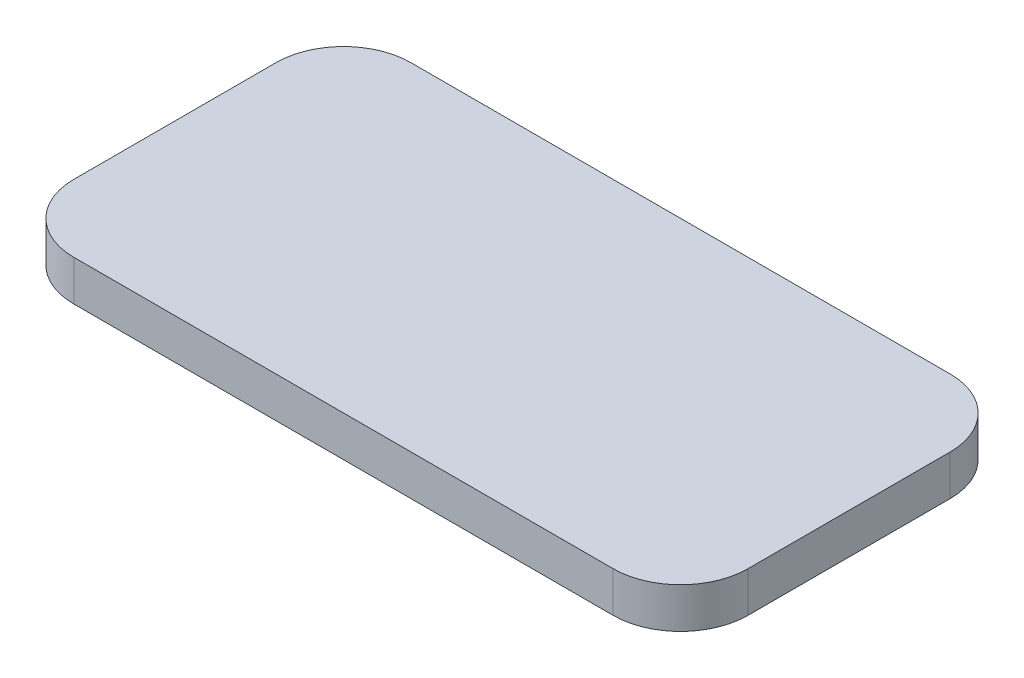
from build123d import *

# Parameters (mm, degrees)
EXTRUDE1_DEPTH = 3


with BuildPart() as part:
    # Sketch1 → Extrude1 (new body)
    with BuildSketch(Plane(origin=(0, 0, 0), x_dir=(1, 0, 0), z_dir=(0, 1, 0))):
        with BuildLine():
            Line((5, 0), (45, 0))
            ThreePointArc((45, 0), (48.535533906, 1.464466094), (50, 5))
            Line((50, 5), (50, 20))
            ThreePointArc((50, 20), (48.535533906, 23.535533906), (45, 25))
            Line((45, 25), (5, 25))
            ThreePointArc((5, 25), (1.464466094, 23.535533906), (0, 20))
            Line((0, 20), (0, 5))
            ThreePointArc((0, 5), (1.464466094, 1.464466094), (5, 0))
        make_face()
    extrude(amount=EXTRUDE1_DEPTH)


solid = part.part
